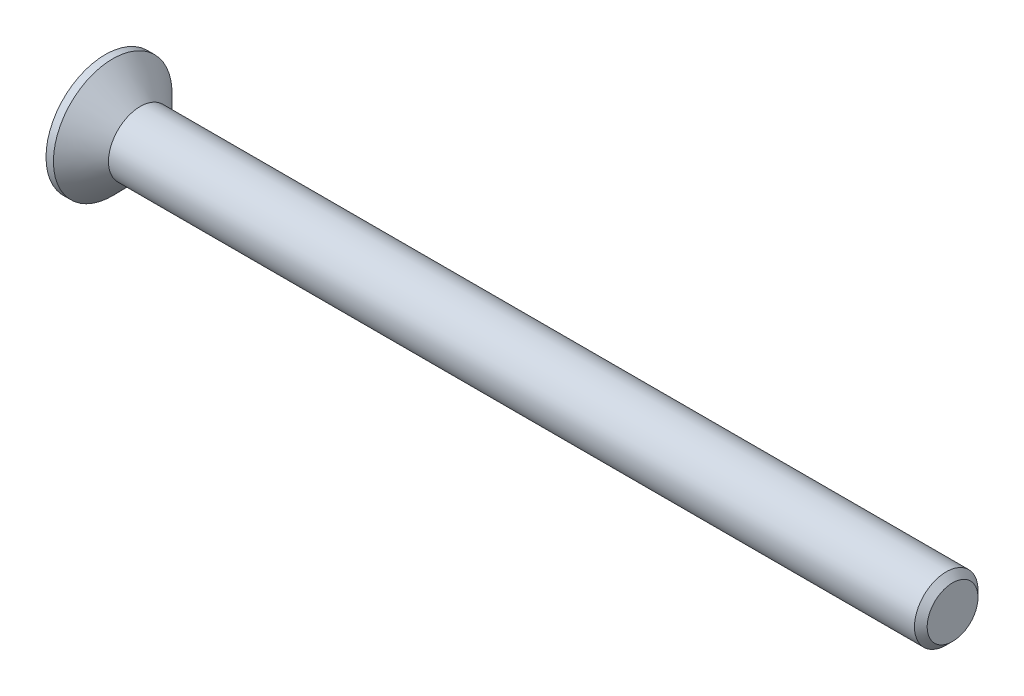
ISO-10303-21;
HEADER;
FILE_DESCRIPTION(('STEP AP214'),'2;1');
FILE_NAME('part.step','',(''),(''),'','','');
FILE_SCHEMA(('AUTOMOTIVE_DESIGN { 1 0 10303 214 1 1 1 1 }'));
ENDSEC;
DATA;
#1=APPLICATION_CONTEXT('core data for automotive mechanical design processes');
#2=APPLICATION_PROTOCOL_DEFINITION('international standard','automotive_design',2000,#1);
#3=PRODUCT_CONTEXT('',#1,'mechanical');
#4=PRODUCT('Part','Part','',(#3));
#5=PRODUCT_RELATED_PRODUCT_CATEGORY('part','',(#4));
#6=PRODUCT_DEFINITION_FORMATION('','',#4);
#7=PRODUCT_DEFINITION_CONTEXT('part definition',#1,'design');
#8=PRODUCT_DEFINITION('design','',#6,#7);
#9=PRODUCT_DEFINITION_SHAPE('','',#8);
#10=(LENGTH_UNIT() NAMED_UNIT(*) SI_UNIT(.MILLI.,.METRE.));
#11=(NAMED_UNIT(*) PLANE_ANGLE_UNIT() SI_UNIT($,.RADIAN.));
#12=(NAMED_UNIT(*) SI_UNIT($,.STERADIAN.) SOLID_ANGLE_UNIT());
#13=UNCERTAINTY_MEASURE_WITH_UNIT(LENGTH_MEASURE(1.E-05),#10,'distance_accuracy_value','');
#14=(GEOMETRIC_REPRESENTATION_CONTEXT(3) GLOBAL_UNCERTAINTY_ASSIGNED_CONTEXT((#13)) GLOBAL_UNIT_ASSIGNED_CONTEXT((#10,
#11,#12)) REPRESENTATION_CONTEXT('',''));
#15=CARTESIAN_POINT('',(0.,0.,0.));
#16=DIRECTION('',(0.,0.,1.));
#17=DIRECTION('',(1.,0.,0.));
#18=AXIS2_PLACEMENT_3D('',#15,#16,#17);
#19=CARTESIAN_POINT('',(0.,0.,0.));
#20=DIRECTION('',(-1.,0.,0.));
#21=DIRECTION('',(0.,0.,1.));
#22=AXIS2_PLACEMENT_3D('',#19,#20,#21);
#23=CONICAL_SURFACE('',#22,1.5,0.78539816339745);
#24=CARTESIAN_POINT('',(-1.3,0.,0.));
#25=DIRECTION('',(-1.,0.,0.));
#26=DIRECTION('',(0.,0.,1.));
#27=AXIS2_PLACEMENT_3D('',#24,#25,#26);
#28=CIRCLE('',#27,2.8);
#29=CARTESIAN_POINT('',(-1.3,0.,2.8));
#30=VERTEX_POINT('',#29);
#31=EDGE_CURVE('E189',#30,#30,#28,.T.);
#32=ORIENTED_EDGE('',*,*,#31,.F.);
#33=EDGE_LOOP('',(#32));
#34=FACE_BOUND('',#33,.T.);
#35=CARTESIAN_POINT('',(0.,0.,0.));
#36=DIRECTION('',(-1.,0.,0.));
#37=DIRECTION('',(0.,0.,1.));
#38=AXIS2_PLACEMENT_3D('',#35,#36,#37);
#39=CIRCLE('',#38,1.5);
#40=CARTESIAN_POINT('',(0.,0.,1.5));
#41=VERTEX_POINT('',#40);
#42=EDGE_CURVE('E212',#41,#41,#39,.T.);
#43=ORIENTED_EDGE('',*,*,#42,.T.);
#44=EDGE_LOOP('',(#43));
#45=FACE_BOUND('',#44,.T.);
#46=ADVANCED_FACE('F33',(#34,#45),#23,.T.);
#47=CARTESIAN_POINT('',(-1.65,0.,0.));
#48=DIRECTION('',(-1.,0.,0.));
#49=DIRECTION('',(0.,0.,1.));
#50=AXIS2_PLACEMENT_3D('',#47,#48,#49);
#51=CYLINDRICAL_SURFACE('',#50,1.5);
#52=CARTESIAN_POINT('',(38.05,0.,0.));
#53=DIRECTION('',(-1.,0.,0.));
#54=DIRECTION('',(0.,0.,1.));
#55=AXIS2_PLACEMENT_3D('',#52,#53,#54);
#56=CIRCLE('',#55,1.5);
#57=CARTESIAN_POINT('',(38.05,0.,1.5));
#58=VERTEX_POINT('',#57);
#59=EDGE_CURVE('E41',#58,#58,#56,.T.);
#60=ORIENTED_EDGE('',*,*,#59,.T.);
#61=EDGE_LOOP('',(#60));
#62=FACE_BOUND('',#61,.T.);
#63=ORIENTED_EDGE('',*,*,#42,.F.);
#64=EDGE_LOOP('',(#63));
#65=FACE_BOUND('',#64,.T.);
#66=ADVANCED_FACE('F217',(#62,#65),#51,.T.);
#67=CARTESIAN_POINT('',(38.35,0.,0.));
#68=DIRECTION('',(-1.,0.,0.));
#69=DIRECTION('',(0.,0.,1.));
#70=AXIS2_PLACEMENT_3D('',#67,#68,#69);
#71=PLANE('',#70);
#72=CARTESIAN_POINT('',(38.35,0.,0.));
#73=DIRECTION('',(-1.,0.,0.));
#74=DIRECTION('',(0.,0.,1.));
#75=AXIS2_PLACEMENT_3D('',#72,#73,#74);
#76=CIRCLE('',#75,1.2);
#77=CARTESIAN_POINT('',(38.35,0.,1.2));
#78=VERTEX_POINT('',#77);
#79=EDGE_CURVE('E11',#78,#78,#76,.F.);
#80=ORIENTED_EDGE('',*,*,#79,.T.);
#81=EDGE_LOOP('',(#80));
#82=FACE_BOUND('',#81,.T.);
#83=ADVANCED_FACE('F239',(#82),#71,.F.);
#84=CARTESIAN_POINT('',(-1.65,2.8,0.));
#85=DIRECTION('',(1.,0.,0.));
#86=DIRECTION('',(0.,0.,-1.));
#87=AXIS2_PLACEMENT_3D('',#84,#85,#86);
#88=PLANE('',#87);
#89=DIRECTION('',(0.,0.,-1.));
#90=VECTOR('',#89,1.);
#91=CARTESIAN_POINT('',(-1.65,0.365,-1.45));
#92=LINE('',#91,#90);
#93=CARTESIAN_POINT('',(-1.65,0.365,-0.365));
#94=VERTEX_POINT('',#93);
#95=CARTESIAN_POINT('',(-1.65,0.365,-1.45));
#96=VERTEX_POINT('',#95);
#97=EDGE_CURVE('E158',#94,#96,#92,.T.);
#98=ORIENTED_EDGE('',*,*,#97,.F.);
#99=DIRECTION('',(0.,-1.,0.));
#100=VECTOR('',#99,1.);
#101=CARTESIAN_POINT('',(-1.65,0.365,-0.365));
#102=LINE('',#101,#100);
#103=CARTESIAN_POINT('',(-1.65,1.45,-0.365));
#104=VERTEX_POINT('',#103);
#105=EDGE_CURVE('E48',#104,#94,#102,.T.);
#106=ORIENTED_EDGE('',*,*,#105,.F.);
#107=DIRECTION('',(0.,0.,-1.));
#108=VECTOR('',#107,1.);
#109=CARTESIAN_POINT('',(-1.65,1.45,-0.365));
#110=LINE('',#109,#108);
#111=CARTESIAN_POINT('',(-1.65,1.45,0.365));
#112=VERTEX_POINT('',#111);
#113=EDGE_CURVE('E185',#112,#104,#110,.T.);
#114=ORIENTED_EDGE('',*,*,#113,.F.);
#115=DIRECTION('',(0.,1.,0.));
#116=VECTOR('',#115,1.);
#117=CARTESIAN_POINT('',(-1.65,1.45,0.365));
#118=LINE('',#117,#116);
#119=CARTESIAN_POINT('',(-1.65,0.365,0.365));
#120=VERTEX_POINT('',#119);
#121=EDGE_CURVE('E183',#120,#112,#118,.T.);
#122=ORIENTED_EDGE('',*,*,#121,.F.);
#123=DIRECTION('',(0.,0.,-1.));
#124=VECTOR('',#123,1.);
#125=CARTESIAN_POINT('',(-1.65,0.365,0.365));
#126=LINE('',#125,#124);
#127=CARTESIAN_POINT('',(-1.65,0.365,1.45));
#128=VERTEX_POINT('',#127);
#129=EDGE_CURVE('E132',#128,#120,#126,.T.);
#130=ORIENTED_EDGE('',*,*,#129,.F.);
#131=DIRECTION('',(0.,1.,0.));
#132=VECTOR('',#131,1.);
#133=CARTESIAN_POINT('',(-1.65,0.365,1.45));
#134=LINE('',#133,#132);
#135=CARTESIAN_POINT('',(-1.65,-0.365,1.45));
#136=VERTEX_POINT('',#135);
#137=EDGE_CURVE('E179',#136,#128,#134,.T.);
#138=ORIENTED_EDGE('',*,*,#137,.F.);
#139=DIRECTION('',(0.,0.,1.));
#140=VECTOR('',#139,1.);
#141=CARTESIAN_POINT('',(-1.65,-0.365,1.45));
#142=LINE('',#141,#140);
#143=CARTESIAN_POINT('',(-1.65,-0.365,0.365));
#144=VERTEX_POINT('',#143);
#145=EDGE_CURVE('E176',#144,#136,#142,.T.);
#146=ORIENTED_EDGE('',*,*,#145,.F.);
#147=DIRECTION('',(0.,1.,0.));
#148=VECTOR('',#147,1.);
#149=CARTESIAN_POINT('',(-1.65,-0.365,0.365));
#150=LINE('',#149,#148);
#151=CARTESIAN_POINT('',(-1.65,-1.45,0.365));
#152=VERTEX_POINT('',#151);
#153=EDGE_CURVE('E173',#152,#144,#150,.T.);
#154=ORIENTED_EDGE('',*,*,#153,.F.);
#155=DIRECTION('',(0.,0.,1.));
#156=VECTOR('',#155,1.);
#157=CARTESIAN_POINT('',(-1.65,-1.45,0.365));
#158=LINE('',#157,#156);
#159=CARTESIAN_POINT('',(-1.65,-1.45,-0.365));
#160=VERTEX_POINT('',#159);
#161=EDGE_CURVE('E170',#160,#152,#158,.T.);
#162=ORIENTED_EDGE('',*,*,#161,.F.);
#163=DIRECTION('',(0.,-1.,0.));
#164=VECTOR('',#163,1.);
#165=CARTESIAN_POINT('',(-1.65,-1.45,-0.365));
#166=LINE('',#165,#164);
#167=CARTESIAN_POINT('',(-1.65,-0.365,-0.365));
#168=VERTEX_POINT('',#167);
#169=EDGE_CURVE('E167',#168,#160,#166,.T.);
#170=ORIENTED_EDGE('',*,*,#169,.F.);
#171=DIRECTION('',(0.,0.,1.));
#172=VECTOR('',#171,1.);
#173=CARTESIAN_POINT('',(-1.65,-0.365,-0.365));
#174=LINE('',#173,#172);
#175=CARTESIAN_POINT('',(-1.65,-0.365,-1.45));
#176=VERTEX_POINT('',#175);
#177=EDGE_CURVE('E164',#176,#168,#174,.T.);
#178=ORIENTED_EDGE('',*,*,#177,.F.);
#179=DIRECTION('',(0.,-1.,0.));
#180=VECTOR('',#179,1.);
#181=CARTESIAN_POINT('',(-1.65,-0.365,-1.45));
#182=LINE('',#181,#180);
#183=EDGE_CURVE('E161',#96,#176,#182,.T.);
#184=ORIENTED_EDGE('',*,*,#183,.F.);
#185=EDGE_LOOP('',(#98,#106,#114,#122,#130,#138,#146,#154,#162,#170,#178,#184));
#186=FACE_BOUND('',#185,.T.);
#187=CARTESIAN_POINT('',(-1.65,0.,0.));
#188=DIRECTION('',(-1.,0.,0.));
#189=DIRECTION('',(0.,0.,1.));
#190=AXIS2_PLACEMENT_3D('',#187,#188,#189);
#191=CIRCLE('',#190,2.8);
#192=CARTESIAN_POINT('',(-1.65,0.,2.8));
#193=VERTEX_POINT('',#192);
#194=EDGE_CURVE('E209',#193,#193,#191,.T.);
#195=ORIENTED_EDGE('',*,*,#194,.T.);
#196=EDGE_LOOP('',(#195));
#197=FACE_BOUND('',#196,.T.);
#198=ADVANCED_FACE('F230',(#186,#197),#88,.F.);
#199=CARTESIAN_POINT('',(-1.65,0.,0.));
#200=DIRECTION('',(-1.,0.,0.));
#201=DIRECTION('',(0.,0.,1.));
#202=AXIS2_PLACEMENT_3D('',#199,#200,#201);
#203=CYLINDRICAL_SURFACE('',#202,2.8);
#204=ORIENTED_EDGE('',*,*,#194,.F.);
#205=EDGE_LOOP('',(#204));
#206=FACE_BOUND('',#205,.T.);
#207=ORIENTED_EDGE('',*,*,#31,.T.);
#208=EDGE_LOOP('',(#207));
#209=FACE_BOUND('',#208,.T.);
#210=ADVANCED_FACE('F222',(#206,#209),#203,.T.);
#211=CARTESIAN_POINT('',(38.05,0.,0.));
#212=DIRECTION('',(-1.,0.,0.));
#213=DIRECTION('',(0.,0.,1.));
#214=AXIS2_PLACEMENT_3D('',#211,#212,#213);
#215=CONICAL_SURFACE('',#214,1.5,0.785398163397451);
#216=ORIENTED_EDGE('',*,*,#79,.F.);
#217=EDGE_LOOP('',(#216));
#218=FACE_BOUND('',#217,.T.);
#219=ORIENTED_EDGE('',*,*,#59,.F.);
#220=EDGE_LOOP('',(#219));
#221=FACE_BOUND('',#220,.T.);
#222=ADVANCED_FACE('F35',(#218,#221),#215,.T.);
#223=CARTESIAN_POINT('',(-0.4,0.365,-0.365));
#224=DIRECTION('',(0.,0.,-1.));
#225=DIRECTION('',(-1.,0.,0.));
#226=AXIS2_PLACEMENT_3D('',#223,#224,#225);
#227=PLANE('',#226);
#228=ORIENTED_EDGE('',*,*,#105,.T.);
#229=DIRECTION('',(-1.,0.,0.));
#230=VECTOR('',#229,1.);
#231=CARTESIAN_POINT('',(-0.4,0.365,-0.365));
#232=LINE('',#231,#230);
#233=CARTESIAN_POINT('',(-0.4,0.365,-0.365));
#234=VERTEX_POINT('',#233);
#235=EDGE_CURVE('E96',#234,#94,#232,.T.);
#236=ORIENTED_EDGE('',*,*,#235,.F.);
#237=DIRECTION('',(0.,-1.,0.));
#238=VECTOR('',#237,1.);
#239=CARTESIAN_POINT('',(-0.4,0.365,-0.365));
#240=LINE('',#239,#238);
#241=CARTESIAN_POINT('',(-0.4,1.45,-0.365));
#242=VERTEX_POINT('',#241);
#243=EDGE_CURVE('E187',#242,#234,#240,.T.);
#244=ORIENTED_EDGE('',*,*,#243,.F.);
#245=DIRECTION('',(-1.,0.,0.));
#246=VECTOR('',#245,1.);
#247=CARTESIAN_POINT('',(-0.4,1.45,-0.365));
#248=LINE('',#247,#246);
#249=EDGE_CURVE('E56',#242,#104,#248,.T.);
#250=ORIENTED_EDGE('',*,*,#249,.T.);
#251=EDGE_LOOP('',(#228,#236,#244,#250));
#252=FACE_BOUND('',#251,.T.);
#253=ADVANCED_FACE('F221',(#252),#227,.F.);
#254=CARTESIAN_POINT('',(-0.4,1.45,-0.365));
#255=DIRECTION('',(0.,1.,0.));
#256=DIRECTION('',(-1.,0.,0.));
#257=AXIS2_PLACEMENT_3D('',#254,#255,#256);
#258=PLANE('',#257);
#259=ORIENTED_EDGE('',*,*,#113,.T.);
#260=ORIENTED_EDGE('',*,*,#249,.F.);
#261=DIRECTION('',(0.,0.,-1.));
#262=VECTOR('',#261,1.);
#263=CARTESIAN_POINT('',(-0.4,1.45,-0.365));
#264=LINE('',#263,#262);
#265=CARTESIAN_POINT('',(-0.4,1.45,0.365));
#266=VERTEX_POINT('',#265);
#267=EDGE_CURVE('E144',#266,#242,#264,.T.);
#268=ORIENTED_EDGE('',*,*,#267,.F.);
#269=DIRECTION('',(-1.,0.,0.));
#270=VECTOR('',#269,1.);
#271=CARTESIAN_POINT('',(-0.4,1.45,0.365));
#272=LINE('',#271,#270);
#273=EDGE_CURVE('E136',#266,#112,#272,.T.);
#274=ORIENTED_EDGE('',*,*,#273,.T.);
#275=EDGE_LOOP('',(#259,#260,#268,#274));
#276=FACE_BOUND('',#275,.T.);
#277=ADVANCED_FACE('F228',(#276),#258,.F.);
#278=CARTESIAN_POINT('',(-0.4,1.45,0.365));
#279=DIRECTION('',(0.,0.,1.));
#280=DIRECTION('',(1.,0.,0.));
#281=AXIS2_PLACEMENT_3D('',#278,#279,#280);
#282=PLANE('',#281);
#283=ORIENTED_EDGE('',*,*,#121,.T.);
#284=ORIENTED_EDGE('',*,*,#273,.F.);
#285=DIRECTION('',(0.,1.,0.));
#286=VECTOR('',#285,1.);
#287=CARTESIAN_POINT('',(-0.4,1.45,0.365));
#288=LINE('',#287,#286);
#289=CARTESIAN_POINT('',(-0.4,0.365,0.365));
#290=VERTEX_POINT('',#289);
#291=EDGE_CURVE('E140',#290,#266,#288,.T.);
#292=ORIENTED_EDGE('',*,*,#291,.F.);
#293=DIRECTION('',(-1.,0.,0.));
#294=VECTOR('',#293,1.);
#295=CARTESIAN_POINT('',(-0.4,0.365,0.365));
#296=LINE('',#295,#294);
#297=EDGE_CURVE('E125',#290,#120,#296,.T.);
#298=ORIENTED_EDGE('',*,*,#297,.T.);
#299=EDGE_LOOP('',(#283,#284,#292,#298));
#300=FACE_BOUND('',#299,.T.);
#301=ADVANCED_FACE('F141',(#300),#282,.F.);
#302=CARTESIAN_POINT('',(-0.4,0.365,0.365));
#303=DIRECTION('',(0.,1.,0.));
#304=DIRECTION('',(-1.,0.,0.));
#305=AXIS2_PLACEMENT_3D('',#302,#303,#304);
#306=PLANE('',#305);
#307=ORIENTED_EDGE('',*,*,#129,.T.);
#308=ORIENTED_EDGE('',*,*,#297,.F.);
#309=DIRECTION('',(0.,0.,-1.));
#310=VECTOR('',#309,1.);
#311=CARTESIAN_POINT('',(-0.4,0.365,0.365));
#312=LINE('',#311,#310);
#313=CARTESIAN_POINT('',(-0.4,0.365,1.45));
#314=VERTEX_POINT('',#313);
#315=EDGE_CURVE('E129',#314,#290,#312,.T.);
#316=ORIENTED_EDGE('',*,*,#315,.F.);
#317=DIRECTION('',(-1.,0.,0.));
#318=VECTOR('',#317,1.);
#319=CARTESIAN_POINT('',(-0.4,0.365,1.45));
#320=LINE('',#319,#318);
#321=EDGE_CURVE('E137',#314,#128,#320,.T.);
#322=ORIENTED_EDGE('',*,*,#321,.T.);
#323=EDGE_LOOP('',(#307,#308,#316,#322));
#324=FACE_BOUND('',#323,.T.);
#325=ADVANCED_FACE('F127',(#324),#306,.F.);
#326=CARTESIAN_POINT('',(-0.4,0.365,1.45));
#327=DIRECTION('',(0.,0.,1.));
#328=DIRECTION('',(1.,0.,0.));
#329=AXIS2_PLACEMENT_3D('',#326,#327,#328);
#330=PLANE('',#329);
#331=ORIENTED_EDGE('',*,*,#137,.T.);
#332=ORIENTED_EDGE('',*,*,#321,.F.);
#333=DIRECTION('',(0.,1.,0.));
#334=VECTOR('',#333,1.);
#335=CARTESIAN_POINT('',(-0.4,0.365,1.45));
#336=LINE('',#335,#334);
#337=CARTESIAN_POINT('',(-0.4,-0.365,1.45));
#338=VERTEX_POINT('',#337);
#339=EDGE_CURVE('E150',#338,#314,#336,.T.);
#340=ORIENTED_EDGE('',*,*,#339,.F.);
#341=DIRECTION('',(-1.,0.,0.));
#342=VECTOR('',#341,1.);
#343=CARTESIAN_POINT('',(-0.4,-0.365,1.45));
#344=LINE('',#343,#342);
#345=EDGE_CURVE('E192',#338,#136,#344,.T.);
#346=ORIENTED_EDGE('',*,*,#345,.T.);
#347=EDGE_LOOP('',(#331,#332,#340,#346));
#348=FACE_BOUND('',#347,.T.);
#349=ADVANCED_FACE('F277',(#348),#330,.F.);
#350=CARTESIAN_POINT('',(-0.4,-0.365,1.45));
#351=DIRECTION('',(0.,-1.,0.));
#352=DIRECTION('',(1.,0.,0.));
#353=AXIS2_PLACEMENT_3D('',#350,#351,#352);
#354=PLANE('',#353);
#355=ORIENTED_EDGE('',*,*,#145,.T.);
#356=ORIENTED_EDGE('',*,*,#345,.F.);
#357=DIRECTION('',(0.,0.,1.));
#358=VECTOR('',#357,1.);
#359=CARTESIAN_POINT('',(-0.4,-0.365,1.45));
#360=LINE('',#359,#358);
#361=CARTESIAN_POINT('',(-0.4,-0.365,0.365));
#362=VERTEX_POINT('',#361);
#363=EDGE_CURVE('E152',#362,#338,#360,.T.);
#364=ORIENTED_EDGE('',*,*,#363,.F.);
#365=DIRECTION('',(-1.,0.,0.));
#366=VECTOR('',#365,1.);
#367=CARTESIAN_POINT('',(-0.4,-0.365,0.365));
#368=LINE('',#367,#366);
#369=EDGE_CURVE('E194',#362,#144,#368,.T.);
#370=ORIENTED_EDGE('',*,*,#369,.T.);
#371=EDGE_LOOP('',(#355,#356,#364,#370));
#372=FACE_BOUND('',#371,.T.);
#373=ADVANCED_FACE('F273',(#372),#354,.F.);
#374=CARTESIAN_POINT('',(-0.4,-0.365,0.365));
#375=DIRECTION('',(0.,0.,1.));
#376=DIRECTION('',(1.,0.,0.));
#377=AXIS2_PLACEMENT_3D('',#374,#375,#376);
#378=PLANE('',#377);
#379=ORIENTED_EDGE('',*,*,#153,.T.);
#380=ORIENTED_EDGE('',*,*,#369,.F.);
#381=DIRECTION('',(0.,1.,0.));
#382=VECTOR('',#381,1.);
#383=CARTESIAN_POINT('',(-0.4,-0.365,0.365));
#384=LINE('',#383,#382);
#385=CARTESIAN_POINT('',(-0.4,-1.45,0.365));
#386=VERTEX_POINT('',#385);
#387=EDGE_CURVE('E422',#386,#362,#384,.T.);
#388=ORIENTED_EDGE('',*,*,#387,.F.);
#389=DIRECTION('',(-1.,0.,0.));
#390=VECTOR('',#389,1.);
#391=CARTESIAN_POINT('',(-0.4,-1.45,0.365));
#392=LINE('',#391,#390);
#393=EDGE_CURVE('E196',#386,#152,#392,.T.);
#394=ORIENTED_EDGE('',*,*,#393,.T.);
#395=EDGE_LOOP('',(#379,#380,#388,#394));
#396=FACE_BOUND('',#395,.T.);
#397=ADVANCED_FACE('F269',(#396),#378,.F.);
#398=CARTESIAN_POINT('',(-0.4,-1.45,0.365));
#399=DIRECTION('',(0.,-1.,0.));
#400=DIRECTION('',(1.,0.,0.));
#401=AXIS2_PLACEMENT_3D('',#398,#399,#400);
#402=PLANE('',#401);
#403=ORIENTED_EDGE('',*,*,#161,.T.);
#404=ORIENTED_EDGE('',*,*,#393,.F.);
#405=DIRECTION('',(0.,0.,1.));
#406=VECTOR('',#405,1.);
#407=CARTESIAN_POINT('',(-0.4,-1.45,0.365));
#408=LINE('',#407,#406);
#409=CARTESIAN_POINT('',(-0.4,-1.45,-0.365));
#410=VERTEX_POINT('',#409);
#411=EDGE_CURVE('E419',#410,#386,#408,.T.);
#412=ORIENTED_EDGE('',*,*,#411,.F.);
#413=DIRECTION('',(-1.,0.,0.));
#414=VECTOR('',#413,1.);
#415=CARTESIAN_POINT('',(-0.4,-1.45,-0.365));
#416=LINE('',#415,#414);
#417=EDGE_CURVE('E198',#410,#160,#416,.T.);
#418=ORIENTED_EDGE('',*,*,#417,.T.);
#419=EDGE_LOOP('',(#403,#404,#412,#418));
#420=FACE_BOUND('',#419,.T.);
#421=ADVANCED_FACE('F265',(#420),#402,.F.);
#422=CARTESIAN_POINT('',(-0.4,-1.45,-0.365));
#423=DIRECTION('',(0.,0.,-1.));
#424=DIRECTION('',(-1.,0.,0.));
#425=AXIS2_PLACEMENT_3D('',#422,#423,#424);
#426=PLANE('',#425);
#427=ORIENTED_EDGE('',*,*,#169,.T.);
#428=ORIENTED_EDGE('',*,*,#417,.F.);
#429=DIRECTION('',(0.,-1.,0.));
#430=VECTOR('',#429,1.);
#431=CARTESIAN_POINT('',(-0.4,-1.45,-0.365));
#432=LINE('',#431,#430);
#433=CARTESIAN_POINT('',(-0.4,-0.365,-0.365));
#434=VERTEX_POINT('',#433);
#435=EDGE_CURVE('E416',#434,#410,#432,.T.);
#436=ORIENTED_EDGE('',*,*,#435,.F.);
#437=DIRECTION('',(-1.,0.,0.));
#438=VECTOR('',#437,1.);
#439=CARTESIAN_POINT('',(-0.4,-0.365,-0.365));
#440=LINE('',#439,#438);
#441=EDGE_CURVE('E200',#434,#168,#440,.T.);
#442=ORIENTED_EDGE('',*,*,#441,.T.);
#443=EDGE_LOOP('',(#427,#428,#436,#442));
#444=FACE_BOUND('',#443,.T.);
#445=ADVANCED_FACE('F261',(#444),#426,.F.);
#446=CARTESIAN_POINT('',(-0.4,-0.365,-0.365));
#447=DIRECTION('',(0.,-1.,0.));
#448=DIRECTION('',(1.,0.,0.));
#449=AXIS2_PLACEMENT_3D('',#446,#447,#448);
#450=PLANE('',#449);
#451=ORIENTED_EDGE('',*,*,#177,.T.);
#452=ORIENTED_EDGE('',*,*,#441,.F.);
#453=DIRECTION('',(0.,0.,1.));
#454=VECTOR('',#453,1.);
#455=CARTESIAN_POINT('',(-0.4,-0.365,-0.365));
#456=LINE('',#455,#454);
#457=CARTESIAN_POINT('',(-0.4,-0.365,-1.45));
#458=VERTEX_POINT('',#457);
#459=EDGE_CURVE('E413',#458,#434,#456,.T.);
#460=ORIENTED_EDGE('',*,*,#459,.F.);
#461=DIRECTION('',(-1.,0.,0.));
#462=VECTOR('',#461,1.);
#463=CARTESIAN_POINT('',(-0.4,-0.365,-1.45));
#464=LINE('',#463,#462);
#465=EDGE_CURVE('E202',#458,#176,#464,.T.);
#466=ORIENTED_EDGE('',*,*,#465,.T.);
#467=EDGE_LOOP('',(#451,#452,#460,#466));
#468=FACE_BOUND('',#467,.T.);
#469=ADVANCED_FACE('F257',(#468),#450,.F.);
#470=CARTESIAN_POINT('',(-0.4,-0.365,-1.45));
#471=DIRECTION('',(0.,0.,-1.));
#472=DIRECTION('',(-1.,0.,0.));
#473=AXIS2_PLACEMENT_3D('',#470,#471,#472);
#474=PLANE('',#473);
#475=ORIENTED_EDGE('',*,*,#183,.T.);
#476=ORIENTED_EDGE('',*,*,#465,.F.);
#477=DIRECTION('',(0.,-1.,0.));
#478=VECTOR('',#477,1.);
#479=CARTESIAN_POINT('',(-0.4,-0.365,-1.45));
#480=LINE('',#479,#478);
#481=CARTESIAN_POINT('',(-0.4,0.365,-1.45));
#482=VERTEX_POINT('',#481);
#483=EDGE_CURVE('E408',#482,#458,#480,.T.);
#484=ORIENTED_EDGE('',*,*,#483,.F.);
#485=DIRECTION('',(-1.,0.,0.));
#486=VECTOR('',#485,1.);
#487=CARTESIAN_POINT('',(-0.4,0.365,-1.45));
#488=LINE('',#487,#486);
#489=EDGE_CURVE('E204',#482,#96,#488,.T.);
#490=ORIENTED_EDGE('',*,*,#489,.T.);
#491=EDGE_LOOP('',(#475,#476,#484,#490));
#492=FACE_BOUND('',#491,.T.);
#493=ADVANCED_FACE('F253',(#492),#474,.F.);
#494=CARTESIAN_POINT('',(-0.4,0.365,-1.45));
#495=DIRECTION('',(0.,1.,0.));
#496=DIRECTION('',(-1.,0.,0.));
#497=AXIS2_PLACEMENT_3D('',#494,#495,#496);
#498=PLANE('',#497);
#499=ORIENTED_EDGE('',*,*,#97,.T.);
#500=ORIENTED_EDGE('',*,*,#489,.F.);
#501=DIRECTION('',(0.,0.,-1.));
#502=VECTOR('',#501,1.);
#503=CARTESIAN_POINT('',(-0.4,0.365,-1.45));
#504=LINE('',#503,#502);
#505=EDGE_CURVE('E406',#234,#482,#504,.T.);
#506=ORIENTED_EDGE('',*,*,#505,.F.);
#507=ORIENTED_EDGE('',*,*,#235,.T.);
#508=EDGE_LOOP('',(#499,#500,#506,#507));
#509=FACE_BOUND('',#508,.T.);
#510=ADVANCED_FACE('F250',(#509),#498,.F.);
#511=CARTESIAN_POINT('',(-0.4,0.,0.));
#512=DIRECTION('',(1.,0.,0.));
#513=DIRECTION('',(0.,0.,-1.));
#514=AXIS2_PLACEMENT_3D('',#511,#512,#513);
#515=PLANE('',#514);
#516=ORIENTED_EDGE('',*,*,#243,.T.);
#517=ORIENTED_EDGE('',*,*,#505,.T.);
#518=ORIENTED_EDGE('',*,*,#483,.T.);
#519=ORIENTED_EDGE('',*,*,#459,.T.);
#520=ORIENTED_EDGE('',*,*,#435,.T.);
#521=ORIENTED_EDGE('',*,*,#411,.T.);
#522=ORIENTED_EDGE('',*,*,#387,.T.);
#523=ORIENTED_EDGE('',*,*,#363,.T.);
#524=ORIENTED_EDGE('',*,*,#339,.T.);
#525=ORIENTED_EDGE('',*,*,#315,.T.);
#526=ORIENTED_EDGE('',*,*,#291,.T.);
#527=ORIENTED_EDGE('',*,*,#267,.T.);
#528=EDGE_LOOP('',(#516,#517,#518,#519,#520,#521,#522,#523,#524,#525,#526,#527));
#529=FACE_BOUND('',#528,.T.);
#530=ADVANCED_FACE('F147',(#529),#515,.F.);
#531=CLOSED_SHELL('',(#46,#66,#83,#198,#210,#222,#253,#277,#301,#325,#349,#373,#397,#421,#445,
#469,#493,#510,#530));
#532=MANIFOLD_SOLID_BREP('B2',#531);
#533=ADVANCED_BREP_SHAPE_REPRESENTATION('',(#18,#532),#14);
#534=SHAPE_DEFINITION_REPRESENTATION(#9,#533);
ENDSEC;
END-ISO-10303-21;
